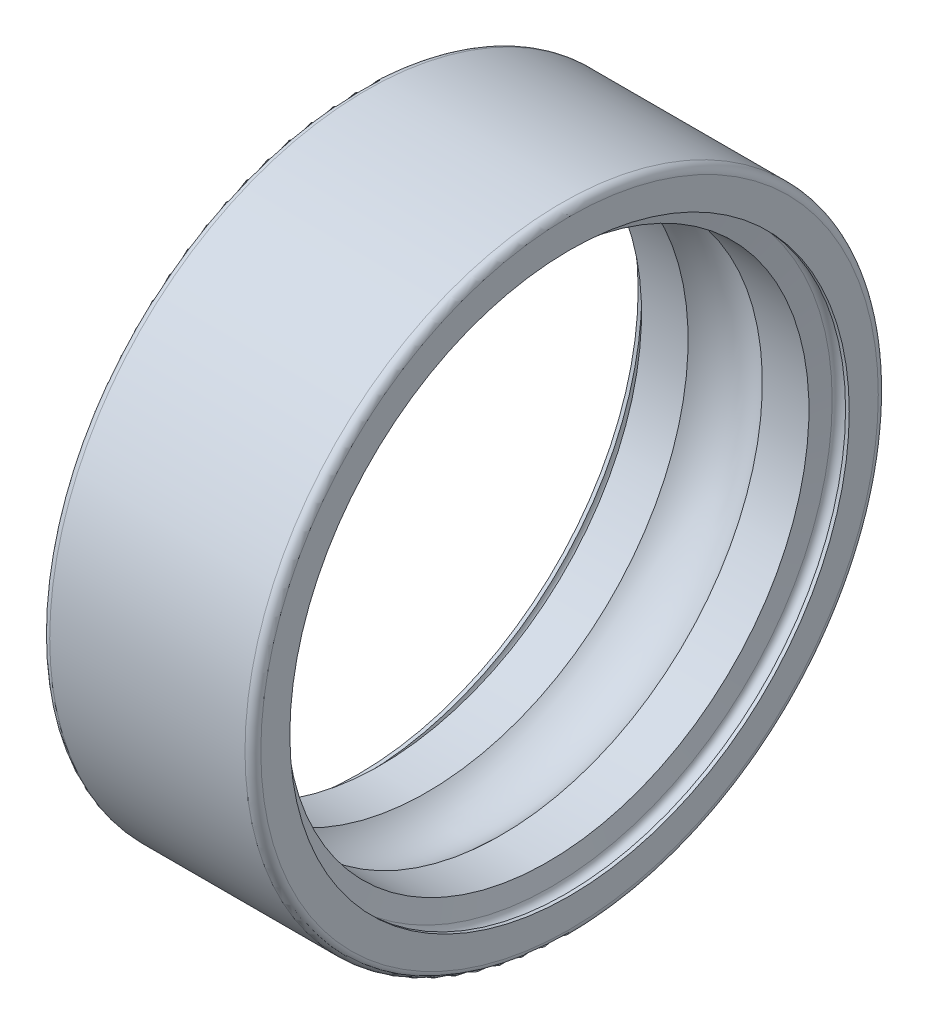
ISO-10303-21;
HEADER;
FILE_DESCRIPTION(('STEP AP214'),'2;1');
FILE_NAME('part.step','',(''),(''),'','','');
FILE_SCHEMA(('AUTOMOTIVE_DESIGN { 1 0 10303 214 1 1 1 1 }'));
ENDSEC;
DATA;
#1=APPLICATION_CONTEXT('core data for automotive mechanical design processes');
#2=APPLICATION_PROTOCOL_DEFINITION('international standard','automotive_design',2000,#1);
#3=PRODUCT_CONTEXT('',#1,'mechanical');
#4=PRODUCT('Part','Part','',(#3));
#5=PRODUCT_RELATED_PRODUCT_CATEGORY('part','',(#4));
#6=PRODUCT_DEFINITION_FORMATION('','',#4);
#7=PRODUCT_DEFINITION_CONTEXT('part definition',#1,'design');
#8=PRODUCT_DEFINITION('design','',#6,#7);
#9=PRODUCT_DEFINITION_SHAPE('','',#8);
#10=(LENGTH_UNIT() NAMED_UNIT(*) SI_UNIT(.MILLI.,.METRE.));
#11=(NAMED_UNIT(*) PLANE_ANGLE_UNIT() SI_UNIT($,.RADIAN.));
#12=(NAMED_UNIT(*) SI_UNIT($,.STERADIAN.) SOLID_ANGLE_UNIT());
#13=UNCERTAINTY_MEASURE_WITH_UNIT(LENGTH_MEASURE(1.E-05),#10,'distance_accuracy_value','');
#14=(GEOMETRIC_REPRESENTATION_CONTEXT(3) GLOBAL_UNCERTAINTY_ASSIGNED_CONTEXT((#13)) GLOBAL_UNIT_ASSIGNED_CONTEXT((#10,
#11,#12)) REPRESENTATION_CONTEXT('',''));
#15=CARTESIAN_POINT('',(0.,0.,0.));
#16=DIRECTION('',(0.,0.,1.));
#17=DIRECTION('',(1.,0.,0.));
#18=AXIS2_PLACEMENT_3D('',#15,#16,#17);
#19=CARTESIAN_POINT('',(7.17225166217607,0.,0.));
#20=DIRECTION('',(1.,0.,0.));
#21=DIRECTION('',(0.,0.,-1.));
#22=AXIS2_PLACEMENT_3D('',#19,#20,#21);
#23=CONICAL_SURFACE('',#22,9.9,1.39626340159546);
#24=CARTESIAN_POINT('',(7.30425382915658,0.,0.));
#25=DIRECTION('',(-1.,0.,0.));
#26=DIRECTION('',(0.,0.,1.));
#27=AXIS2_PLACEMENT_3D('',#24,#25,#26);
#28=CIRCLE('',#27,10.6486214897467);
#29=CARTESIAN_POINT('',(7.30425382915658,0.,10.6486214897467));
#30=VERTEX_POINT('',#29);
#31=EDGE_CURVE('E10',#30,#30,#28,.T.);
#32=ORIENTED_EDGE('',*,*,#31,.F.);
#33=EDGE_LOOP('',(#32));
#34=FACE_BOUND('',#33,.T.);
#35=CARTESIAN_POINT('',(7.17225166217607,0.,0.));
#36=DIRECTION('',(-1.,0.,0.));
#37=DIRECTION('',(0.,0.,1.));
#38=AXIS2_PLACEMENT_3D('',#35,#36,#37);
#39=CIRCLE('',#38,9.9);
#40=CARTESIAN_POINT('',(7.17225166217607,0.,9.9));
#41=VERTEX_POINT('',#40);
#42=EDGE_CURVE('E81',#41,#41,#39,.T.);
#43=ORIENTED_EDGE('',*,*,#42,.T.);
#44=EDGE_LOOP('',(#43));
#45=FACE_BOUND('',#44,.T.);
#46=ADVANCED_FACE('F15',(#34,#45),#23,.F.);
#47=CARTESIAN_POINT('',(7.58,0.,0.));
#48=DIRECTION('',(-1.,0.,0.));
#49=DIRECTION('',(0.,0.,1.));
#50=AXIS2_PLACEMENT_3D('',#47,#48,#49);
#51=TOROIDAL_SURFACE('',#50,10.6,0.28);
#52=ORIENTED_EDGE('',*,*,#31,.T.);
#53=EDGE_LOOP('',(#52));
#54=FACE_BOUND('',#53,.T.);
#55=CARTESIAN_POINT('',(7.86,0.,0.));
#56=DIRECTION('',(-1.,0.,0.));
#57=DIRECTION('',(0.,0.,1.));
#58=AXIS2_PLACEMENT_3D('',#55,#56,#57);
#59=CIRCLE('',#58,10.6);
#60=CARTESIAN_POINT('',(7.86,0.,10.6));
#61=VERTEX_POINT('',#60);
#62=EDGE_CURVE('E22',#61,#61,#59,.T.);
#63=ORIENTED_EDGE('',*,*,#62,.F.);
#64=EDGE_LOOP('',(#63));
#65=FACE_BOUND('',#64,.T.);
#66=ADVANCED_FACE('F106',(#54,#65),#51,.F.);
#67=CARTESIAN_POINT('',(0.,0.,0.));
#68=DIRECTION('',(-1.,0.,0.));
#69=DIRECTION('',(0.,0.,1.));
#70=AXIS2_PLACEMENT_3D('',#67,#68,#69);
#71=CYLINDRICAL_SURFACE('',#70,10.6);
#72=ORIENTED_EDGE('',*,*,#62,.T.);
#73=EDGE_LOOP('',(#72));
#74=FACE_BOUND('',#73,.T.);
#75=CARTESIAN_POINT('',(8.,0.,0.));
#76=DIRECTION('',(-1.,0.,0.));
#77=DIRECTION('',(0.,0.,1.));
#78=AXIS2_PLACEMENT_3D('',#75,#76,#77);
#79=CIRCLE('',#78,10.6);
#80=CARTESIAN_POINT('',(8.,0.,10.6));
#81=VERTEX_POINT('',#80);
#82=EDGE_CURVE('E31',#81,#81,#79,.T.);
#83=ORIENTED_EDGE('',*,*,#82,.F.);
#84=EDGE_LOOP('',(#83));
#85=FACE_BOUND('',#84,.T.);
#86=ADVANCED_FACE('F111',(#74,#85),#71,.F.);
#87=CARTESIAN_POINT('',(8.,10.6,0.));
#88=DIRECTION('',(-1.,0.,0.));
#89=DIRECTION('',(0.,0.,1.));
#90=AXIS2_PLACEMENT_3D('',#87,#88,#89);
#91=PLANE('',#90);
#92=CARTESIAN_POINT('',(8.,0.,0.));
#93=DIRECTION('',(-1.,0.,0.));
#94=DIRECTION('',(0.,0.,1.));
#95=AXIS2_PLACEMENT_3D('',#92,#93,#94);
#96=CIRCLE('',#95,11.7);
#97=CARTESIAN_POINT('',(8.,0.,11.7));
#98=VERTEX_POINT('',#97);
#99=EDGE_CURVE('E39',#98,#98,#96,.T.);
#100=ORIENTED_EDGE('',*,*,#99,.F.);
#101=EDGE_LOOP('',(#100));
#102=FACE_BOUND('',#101,.T.);
#103=ORIENTED_EDGE('',*,*,#82,.T.);
#104=EDGE_LOOP('',(#103));
#105=FACE_BOUND('',#104,.T.);
#106=ADVANCED_FACE('F115',(#102,#105),#91,.F.);
#107=CARTESIAN_POINT('',(7.7,0.,0.));
#108=DIRECTION('',(-1.,0.,0.));
#109=DIRECTION('',(0.,0.,1.));
#110=AXIS2_PLACEMENT_3D('',#107,#108,#109);
#111=TOROIDAL_SURFACE('',#110,11.7,0.3);
#112=CARTESIAN_POINT('',(7.7,0.,0.));
#113=DIRECTION('',(-1.,0.,0.));
#114=DIRECTION('',(0.,0.,1.));
#115=AXIS2_PLACEMENT_3D('',#112,#113,#114);
#116=CIRCLE('',#115,12.);
#117=CARTESIAN_POINT('',(7.7,0.,12.));
#118=VERTEX_POINT('',#117);
#119=EDGE_CURVE('E45',#118,#118,#116,.T.);
#120=ORIENTED_EDGE('',*,*,#119,.F.);
#121=EDGE_LOOP('',(#120));
#122=FACE_BOUND('',#121,.T.);
#123=ORIENTED_EDGE('',*,*,#99,.T.);
#124=EDGE_LOOP('',(#123));
#125=FACE_BOUND('',#124,.T.);
#126=ADVANCED_FACE('F121',(#122,#125),#111,.T.);
#127=CARTESIAN_POINT('',(0.,0.,0.));
#128=DIRECTION('',(-1.,0.,0.));
#129=DIRECTION('',(0.,0.,1.));
#130=AXIS2_PLACEMENT_3D('',#127,#128,#129);
#131=CYLINDRICAL_SURFACE('',#130,12.);
#132=ORIENTED_EDGE('',*,*,#119,.T.);
#133=EDGE_LOOP('',(#132));
#134=FACE_BOUND('',#133,.T.);
#135=CARTESIAN_POINT('',(0.3,0.,0.));
#136=DIRECTION('',(-1.,0.,0.));
#137=DIRECTION('',(0.,0.,1.));
#138=AXIS2_PLACEMENT_3D('',#135,#136,#137);
#139=CIRCLE('',#138,12.);
#140=CARTESIAN_POINT('',(0.3,0.,12.));
#141=VERTEX_POINT('',#140);
#142=EDGE_CURVE('E49',#141,#141,#139,.T.);
#143=ORIENTED_EDGE('',*,*,#142,.F.);
#144=EDGE_LOOP('',(#143));
#145=FACE_BOUND('',#144,.T.);
#146=ADVANCED_FACE('F125',(#134,#145),#131,.T.);
#147=CARTESIAN_POINT('',(0.3,0.,0.));
#148=DIRECTION('',(-1.,0.,0.));
#149=DIRECTION('',(0.,0.,1.));
#150=AXIS2_PLACEMENT_3D('',#147,#148,#149);
#151=TOROIDAL_SURFACE('',#150,11.7,0.3);
#152=CARTESIAN_POINT('',(0.,0.,0.));
#153=DIRECTION('',(-1.,0.,0.));
#154=DIRECTION('',(0.,0.,1.));
#155=AXIS2_PLACEMENT_3D('',#152,#153,#154);
#156=CIRCLE('',#155,11.7);
#157=CARTESIAN_POINT('',(0.,0.,11.7));
#158=VERTEX_POINT('',#157);
#159=EDGE_CURVE('E53',#158,#158,#156,.T.);
#160=ORIENTED_EDGE('',*,*,#159,.F.);
#161=EDGE_LOOP('',(#160));
#162=FACE_BOUND('',#161,.T.);
#163=ORIENTED_EDGE('',*,*,#142,.T.);
#164=EDGE_LOOP('',(#163));
#165=FACE_BOUND('',#164,.T.);
#166=ADVANCED_FACE('F129',(#162,#165),#151,.T.);
#167=CARTESIAN_POINT('',(0.,10.6,0.));
#168=DIRECTION('',(-1.,0.,0.));
#169=DIRECTION('',(0.,0.,1.));
#170=AXIS2_PLACEMENT_3D('',#167,#168,#169);
#171=PLANE('',#170);
#172=ORIENTED_EDGE('',*,*,#159,.T.);
#173=EDGE_LOOP('',(#172));
#174=FACE_BOUND('',#173,.T.);
#175=CARTESIAN_POINT('',(0.,0.,0.));
#176=DIRECTION('',(-1.,0.,0.));
#177=DIRECTION('',(0.,0.,1.));
#178=AXIS2_PLACEMENT_3D('',#175,#176,#177);
#179=CIRCLE('',#178,10.6);
#180=CARTESIAN_POINT('',(0.,0.,10.6));
#181=VERTEX_POINT('',#180);
#182=EDGE_CURVE('E57',#181,#181,#179,.T.);
#183=ORIENTED_EDGE('',*,*,#182,.F.);
#184=EDGE_LOOP('',(#183));
#185=FACE_BOUND('',#184,.T.);
#186=ADVANCED_FACE('F133',(#174,#185),#171,.T.);
#187=CARTESIAN_POINT('',(0.,0.,0.));
#188=DIRECTION('',(-1.,0.,0.));
#189=DIRECTION('',(0.,0.,1.));
#190=AXIS2_PLACEMENT_3D('',#187,#188,#189);
#191=CYLINDRICAL_SURFACE('',#190,10.6);
#192=CARTESIAN_POINT('',(0.14,0.,0.));
#193=DIRECTION('',(-1.,0.,0.));
#194=DIRECTION('',(0.,0.,1.));
#195=AXIS2_PLACEMENT_3D('',#192,#193,#194);
#196=CIRCLE('',#195,10.6);
#197=CARTESIAN_POINT('',(0.14,0.,10.6));
#198=VERTEX_POINT('',#197);
#199=EDGE_CURVE('E61',#198,#198,#196,.T.);
#200=ORIENTED_EDGE('',*,*,#199,.F.);
#201=EDGE_LOOP('',(#200));
#202=FACE_BOUND('',#201,.T.);
#203=ORIENTED_EDGE('',*,*,#182,.T.);
#204=EDGE_LOOP('',(#203));
#205=FACE_BOUND('',#204,.T.);
#206=ADVANCED_FACE('F137',(#202,#205),#191,.F.);
#207=CARTESIAN_POINT('',(0.42,0.,0.));
#208=DIRECTION('',(-1.,0.,0.));
#209=DIRECTION('',(0.,0.,1.));
#210=AXIS2_PLACEMENT_3D('',#207,#208,#209);
#211=TOROIDAL_SURFACE('',#210,10.6,0.28);
#212=ORIENTED_EDGE('',*,*,#199,.T.);
#213=EDGE_LOOP('',(#212));
#214=FACE_BOUND('',#213,.T.);
#215=CARTESIAN_POINT('',(0.695746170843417,0.,0.));
#216=DIRECTION('',(-1.,0.,0.));
#217=DIRECTION('',(0.,0.,1.));
#218=AXIS2_PLACEMENT_3D('',#215,#216,#217);
#219=CIRCLE('',#218,10.6486214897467);
#220=CARTESIAN_POINT('',(0.695746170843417,0.,10.6486214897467));
#221=VERTEX_POINT('',#220);
#222=EDGE_CURVE('E65',#221,#221,#219,.T.);
#223=ORIENTED_EDGE('',*,*,#222,.F.);
#224=EDGE_LOOP('',(#223));
#225=FACE_BOUND('',#224,.T.);
#226=ADVANCED_FACE('F141',(#214,#225),#211,.F.);
#227=CARTESIAN_POINT('',(0.827748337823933,0.,0.));
#228=DIRECTION('',(-1.,0.,0.));
#229=DIRECTION('',(0.,0.,1.));
#230=AXIS2_PLACEMENT_3D('',#227,#228,#229);
#231=CONICAL_SURFACE('',#230,9.9,1.39626340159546);
#232=ORIENTED_EDGE('',*,*,#222,.T.);
#233=EDGE_LOOP('',(#232));
#234=FACE_BOUND('',#233,.T.);
#235=CARTESIAN_POINT('',(0.827748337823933,0.,0.));
#236=DIRECTION('',(-1.,0.,0.));
#237=DIRECTION('',(0.,0.,1.));
#238=AXIS2_PLACEMENT_3D('',#235,#236,#237);
#239=CIRCLE('',#238,9.9);
#240=CARTESIAN_POINT('',(0.827748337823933,0.,9.9));
#241=VERTEX_POINT('',#240);
#242=EDGE_CURVE('E69',#241,#241,#239,.T.);
#243=ORIENTED_EDGE('',*,*,#242,.F.);
#244=EDGE_LOOP('',(#243));
#245=FACE_BOUND('',#244,.T.);
#246=ADVANCED_FACE('F102',(#234,#245),#231,.F.);
#247=CARTESIAN_POINT('',(0.,0.,0.));
#248=DIRECTION('',(-1.,0.,0.));
#249=DIRECTION('',(0.,0.,1.));
#250=AXIS2_PLACEMENT_3D('',#247,#248,#249);
#251=CYLINDRICAL_SURFACE('',#250,9.9);
#252=CARTESIAN_POINT('',(2.5935007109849,0.,0.));
#253=DIRECTION('',(-1.,0.,0.));
#254=DIRECTION('',(0.,0.,1.));
#255=AXIS2_PLACEMENT_3D('',#252,#253,#254);
#256=CIRCLE('',#255,9.9);
#257=CARTESIAN_POINT('',(2.5935007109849,0.,9.9));
#258=VERTEX_POINT('',#257);
#259=EDGE_CURVE('E73',#258,#258,#256,.T.);
#260=ORIENTED_EDGE('',*,*,#259,.F.);
#261=EDGE_LOOP('',(#260));
#262=FACE_BOUND('',#261,.T.);
#263=ORIENTED_EDGE('',*,*,#242,.T.);
#264=EDGE_LOOP('',(#263));
#265=FACE_BOUND('',#264,.T.);
#266=ADVANCED_FACE('F95',(#262,#265),#251,.F.);
#267=CARTESIAN_POINT('',(4.,0.,0.));
#268=DIRECTION('',(-1.,0.,0.));
#269=DIRECTION('',(0.,0.,1.));
#270=AXIS2_PLACEMENT_3D('',#267,#268,#269);
#271=TOROIDAL_SURFACE('',#270,8.5,1.9845);
#272=ORIENTED_EDGE('',*,*,#259,.T.);
#273=EDGE_LOOP('',(#272));
#274=FACE_BOUND('',#273,.T.);
#275=CARTESIAN_POINT('',(5.40649928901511,0.,0.));
#276=DIRECTION('',(-1.,0.,0.));
#277=DIRECTION('',(0.,0.,1.));
#278=AXIS2_PLACEMENT_3D('',#275,#276,#277);
#279=CIRCLE('',#278,9.9);
#280=CARTESIAN_POINT('',(5.40649928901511,0.,9.9));
#281=VERTEX_POINT('',#280);
#282=EDGE_CURVE('E77',#281,#281,#279,.T.);
#283=ORIENTED_EDGE('',*,*,#282,.F.);
#284=EDGE_LOOP('',(#283));
#285=FACE_BOUND('',#284,.T.);
#286=ADVANCED_FACE('F90',(#274,#285),#271,.F.);
#287=CARTESIAN_POINT('',(0.,0.,0.));
#288=DIRECTION('',(-1.,0.,0.));
#289=DIRECTION('',(0.,0.,1.));
#290=AXIS2_PLACEMENT_3D('',#287,#288,#289);
#291=CYLINDRICAL_SURFACE('',#290,9.9);
#292=ORIENTED_EDGE('',*,*,#42,.F.);
#293=EDGE_LOOP('',(#292));
#294=FACE_BOUND('',#293,.T.);
#295=ORIENTED_EDGE('',*,*,#282,.T.);
#296=EDGE_LOOP('',(#295));
#297=FACE_BOUND('',#296,.T.);
#298=ADVANCED_FACE('F87',(#294,#297),#291,.F.);
#299=CLOSED_SHELL('',(#46,#66,#86,#106,#126,#146,#166,#186,#206,#226,#246,#266,#286,#298));
#300=MANIFOLD_SOLID_BREP('B1',#299);
#301=ADVANCED_BREP_SHAPE_REPRESENTATION('',(#18,#300),#14);
#302=SHAPE_DEFINITION_REPRESENTATION(#9,#301);
ENDSEC;
END-ISO-10303-21;
